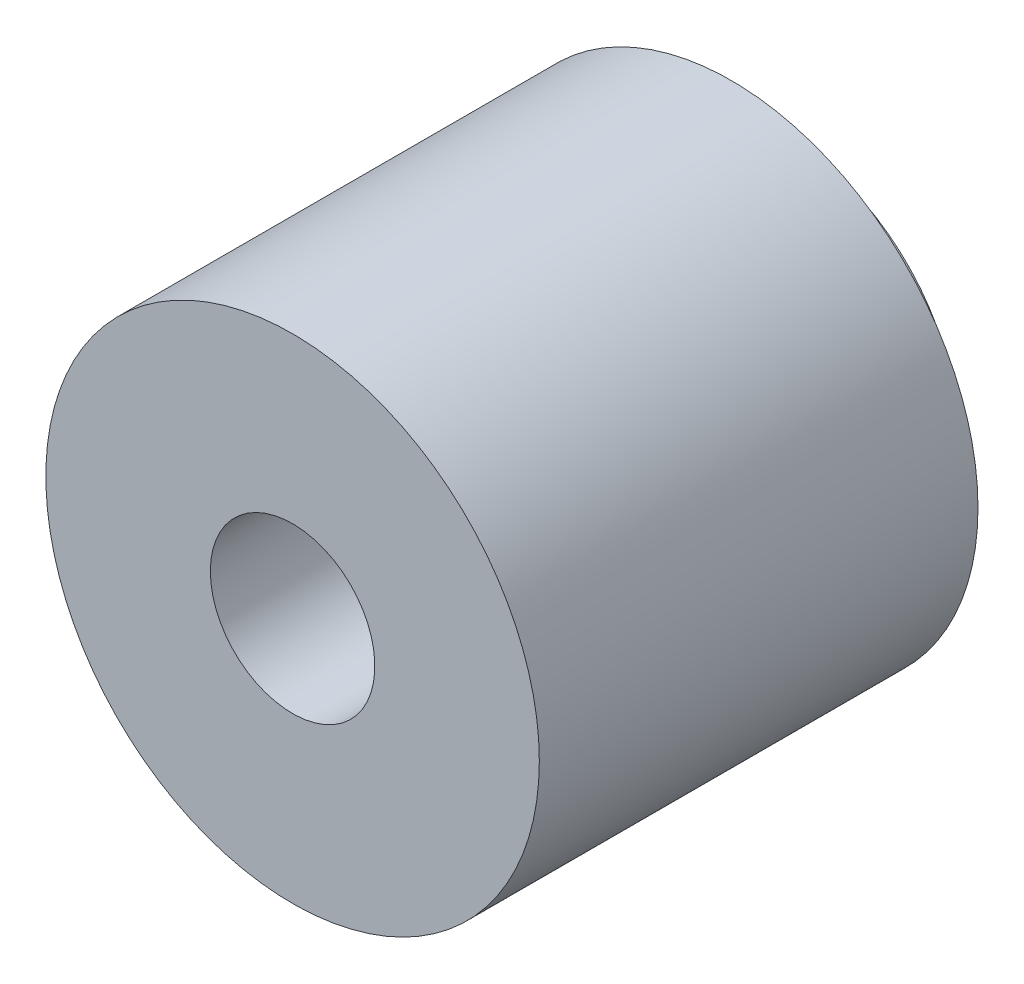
ISO-10303-21;
HEADER;
FILE_DESCRIPTION(('STEP AP214'),'2;1');
FILE_NAME('part.step','',(''),(''),'','','');
FILE_SCHEMA(('AUTOMOTIVE_DESIGN { 1 0 10303 214 1 1 1 1 }'));
ENDSEC;
DATA;
#1=APPLICATION_CONTEXT('core data for automotive mechanical design processes');
#2=APPLICATION_PROTOCOL_DEFINITION('international standard','automotive_design',2000,#1);
#3=PRODUCT_CONTEXT('',#1,'mechanical');
#4=PRODUCT('Part','Part','',(#3));
#5=PRODUCT_RELATED_PRODUCT_CATEGORY('part','',(#4));
#6=PRODUCT_DEFINITION_FORMATION('','',#4);
#7=PRODUCT_DEFINITION_CONTEXT('part definition',#1,'design');
#8=PRODUCT_DEFINITION('design','',#6,#7);
#9=PRODUCT_DEFINITION_SHAPE('','',#8);
#10=(LENGTH_UNIT() NAMED_UNIT(*) SI_UNIT(.MILLI.,.METRE.));
#11=(NAMED_UNIT(*) PLANE_ANGLE_UNIT() SI_UNIT($,.RADIAN.));
#12=(NAMED_UNIT(*) SI_UNIT($,.STERADIAN.) SOLID_ANGLE_UNIT());
#13=UNCERTAINTY_MEASURE_WITH_UNIT(LENGTH_MEASURE(1.E-05),#10,'distance_accuracy_value','');
#14=(GEOMETRIC_REPRESENTATION_CONTEXT(3) GLOBAL_UNCERTAINTY_ASSIGNED_CONTEXT((#13)) GLOBAL_UNIT_ASSIGNED_CONTEXT((#10,
#11,#12)) REPRESENTATION_CONTEXT('',''));
#15=CARTESIAN_POINT('',(0.,0.,0.));
#16=DIRECTION('',(0.,0.,1.));
#17=DIRECTION('',(1.,0.,0.));
#18=AXIS2_PLACEMENT_3D('',#15,#16,#17);
#19=CARTESIAN_POINT('',(0.,0.,56.));
#20=DIRECTION('',(0.,0.,1.));
#21=DIRECTION('',(1.,0.,0.));
#22=AXIS2_PLACEMENT_3D('',#19,#20,#21);
#23=CYLINDRICAL_SURFACE('',#22,18.);
#24=CARTESIAN_POINT('',(0.,0.,36.));
#25=DIRECTION('',(0.,0.,1.));
#26=DIRECTION('',(1.,0.,0.));
#27=AXIS2_PLACEMENT_3D('',#24,#25,#26);
#28=CIRCLE('',#27,18.);
#29=CARTESIAN_POINT('',(18.,0.,36.));
#30=VERTEX_POINT('',#29);
#31=EDGE_CURVE('E8',#30,#30,#28,.T.);
#32=ORIENTED_EDGE('',*,*,#31,.F.);
#33=EDGE_LOOP('',(#32));
#34=FACE_BOUND('',#33,.T.);
#35=CARTESIAN_POINT('',(0.,0.,4.));
#36=DIRECTION('',(0.,0.,-1.));
#37=DIRECTION('',(-1.,0.,0.));
#38=AXIS2_PLACEMENT_3D('',#35,#36,#37);
#39=CIRCLE('',#38,18.);
#40=CARTESIAN_POINT('',(-18.,0.,4.));
#41=VERTEX_POINT('',#40);
#42=EDGE_CURVE('E28',#41,#41,#39,.F.);
#43=ORIENTED_EDGE('',*,*,#42,.T.);
#44=EDGE_LOOP('',(#43));
#45=FACE_BOUND('',#44,.T.);
#46=ADVANCED_FACE('F12',(#34,#45),#23,.T.);
#47=CARTESIAN_POINT('',(0.,0.,36.));
#48=DIRECTION('',(0.,0.,1.));
#49=DIRECTION('',(1.,0.,0.));
#50=AXIS2_PLACEMENT_3D('',#47,#48,#49);
#51=PLANE('',#50);
#52=ORIENTED_EDGE('',*,*,#31,.T.);
#53=EDGE_LOOP('',(#52));
#54=FACE_BOUND('',#53,.T.);
#55=CARTESIAN_POINT('',(0.,0.,36.));
#56=DIRECTION('',(0.,0.,-1.));
#57=DIRECTION('',(-1.,0.,0.));
#58=AXIS2_PLACEMENT_3D('',#55,#56,#57);
#59=CIRCLE('',#58,6.);
#60=CARTESIAN_POINT('',(-6.,0.,36.));
#61=VERTEX_POINT('',#60);
#62=EDGE_CURVE('E25',#61,#61,#59,.T.);
#63=ORIENTED_EDGE('',*,*,#62,.T.);
#64=EDGE_LOOP('',(#63));
#65=FACE_BOUND('',#64,.T.);
#66=ADVANCED_FACE('F41',(#54,#65),#51,.T.);
#67=CARTESIAN_POINT('',(0.,0.,24.));
#68=DIRECTION('',(0.,0.,1.));
#69=DIRECTION('',(1.,0.,0.));
#70=AXIS2_PLACEMENT_3D('',#67,#68,#69);
#71=CYLINDRICAL_SURFACE('',#70,6.);
#72=CARTESIAN_POINT('',(0.,0.,24.));
#73=DIRECTION('',(0.,0.,-1.));
#74=DIRECTION('',(-1.,0.,0.));
#75=AXIS2_PLACEMENT_3D('',#72,#73,#74);
#76=CIRCLE('',#75,6.);
#77=CARTESIAN_POINT('',(-6.,0.,24.));
#78=VERTEX_POINT('',#77);
#79=EDGE_CURVE('E20',#78,#78,#76,.T.);
#80=ORIENTED_EDGE('',*,*,#79,.T.);
#81=EDGE_LOOP('',(#80));
#82=FACE_BOUND('',#81,.T.);
#83=ORIENTED_EDGE('',*,*,#62,.F.);
#84=EDGE_LOOP('',(#83));
#85=FACE_BOUND('',#84,.T.);
#86=ADVANCED_FACE('F43',(#82,#85),#71,.F.);
#87=CARTESIAN_POINT('',(0.,0.,24.));
#88=DIRECTION('',(0.,0.,-1.));
#89=DIRECTION('',(-1.,0.,0.));
#90=AXIS2_PLACEMENT_3D('',#87,#88,#89);
#91=PLANE('',#90);
#92=ORIENTED_EDGE('',*,*,#79,.F.);
#93=EDGE_LOOP('',(#92));
#94=FACE_BOUND('',#93,.T.);
#95=ADVANCED_FACE('F45',(#94),#91,.F.);
#96=CARTESIAN_POINT('',(0.,12.5,4.));
#97=DIRECTION('',(0.,0.,-1.));
#98=DIRECTION('',(-1.,0.,0.));
#99=AXIS2_PLACEMENT_3D('',#96,#97,#98);
#100=PLANE('',#99);
#101=ORIENTED_EDGE('',*,*,#42,.F.);
#102=EDGE_LOOP('',(#101));
#103=FACE_BOUND('',#102,.T.);
#104=CARTESIAN_POINT('',(0.,0.,4.));
#105=DIRECTION('',(0.,0.,-1.));
#106=DIRECTION('',(-1.,0.,0.));
#107=AXIS2_PLACEMENT_3D('',#104,#105,#106);
#108=CIRCLE('',#107,12.5);
#109=CARTESIAN_POINT('',(-12.5,0.,4.));
#110=VERTEX_POINT('',#109);
#111=EDGE_CURVE('E30',#110,#110,#108,.T.);
#112=ORIENTED_EDGE('',*,*,#111,.F.);
#113=EDGE_LOOP('',(#112));
#114=FACE_BOUND('',#113,.T.);
#115=ADVANCED_FACE('F48',(#103,#114),#100,.T.);
#116=CARTESIAN_POINT('',(0.,0.,-4.));
#117=DIRECTION('',(0.,0.,-1.));
#118=DIRECTION('',(-1.,0.,0.));
#119=AXIS2_PLACEMENT_3D('',#116,#117,#118);
#120=CYLINDRICAL_SURFACE('',#119,12.5);
#121=CARTESIAN_POINT('',(0.,0.,0.));
#122=DIRECTION('',(0.,0.,-1.));
#123=DIRECTION('',(-1.,0.,0.));
#124=AXIS2_PLACEMENT_3D('',#121,#122,#123);
#125=CIRCLE('',#124,12.5);
#126=CARTESIAN_POINT('',(-12.5,0.,0.));
#127=VERTEX_POINT('',#126);
#128=EDGE_CURVE('E16',#127,#127,#125,.F.);
#129=ORIENTED_EDGE('',*,*,#128,.T.);
#130=EDGE_LOOP('',(#129));
#131=FACE_BOUND('',#130,.T.);
#132=ORIENTED_EDGE('',*,*,#111,.T.);
#133=EDGE_LOOP('',(#132));
#134=FACE_BOUND('',#133,.T.);
#135=ADVANCED_FACE('F58',(#131,#134),#120,.T.);
#136=CARTESIAN_POINT('',(18.,0.,0.));
#137=DIRECTION('',(0.,0.,-1.));
#138=DIRECTION('',(-1.,0.,0.));
#139=AXIS2_PLACEMENT_3D('',#136,#137,#138);
#140=PLANE('',#139);
#141=ORIENTED_EDGE('',*,*,#128,.F.);
#142=EDGE_LOOP('',(#141));
#143=FACE_BOUND('',#142,.T.);
#144=ADVANCED_FACE('F14',(#143),#140,.T.);
#145=CLOSED_SHELL('',(#46,#66,#86,#95,#115,#135,#144));
#146=MANIFOLD_SOLID_BREP('B1',#145);
#147=ADVANCED_BREP_SHAPE_REPRESENTATION('',(#18,#146),#14);
#148=SHAPE_DEFINITION_REPRESENTATION(#9,#147);
ENDSEC;
END-ISO-10303-21;
